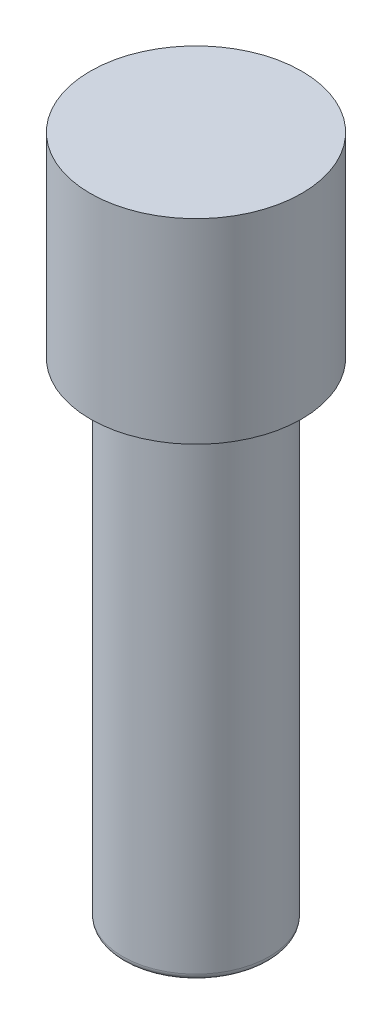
from build123d import *

# Parameters (mm, degrees)
CROQUIS1_R              = 2.25
CROQUIS1_R_2            = 1.4
SALIENTE_EXTRUIR1_DEPTH = 10
SALIENTE_EXTRUIR2_START = 10
CROQUIS1_2_R            = 2.25
SALIENTE_EXTRUIR2_DEPTH = 5
REDONDEO1_R             = 0.2
CROQUIS2_R              = 3.25
SALIENTE_EXTRUIR3_DEPTH = 6


with BuildPart() as part:
    # Croquis1 → Saliente-Extruir1 (new body)
    with BuildSketch(Plane(origin=(0, 0, 0), x_dir=(1, 0, 0), z_dir=(0, 1, 0))):
        with Locations(Location((0, 0, 0), (0, 0, 270))):
            Circle(CROQUIS1_R)
        with Locations(Location((0, 0, 0), (0, 0, 270))):
            Circle(CROQUIS1_R_2, mode=Mode.SUBTRACT)
    extrude(amount=SALIENTE_EXTRUIR1_DEPTH)

    # Croquis1_2 → Saliente-Extruir2 (add)
    with BuildSketch(Plane(origin=(0, 0, 0), x_dir=(1, 0, 0), z_dir=(0, 1, 0)).offset(SALIENTE_EXTRUIR2_START)):
        with Locations(Location((0, 0, 0), (0, 0, 270))):
            Circle(CROQUIS1_2_R)
    extrude(amount=SALIENTE_EXTRUIR2_DEPTH)

    # Redondeo1
    redondeo1_edges = [part.edges().sort_by_distance(p)[0] for p in [
        (0, 0, -2.25),
    ]]
    fillet(redondeo1_edges, radius=REDONDEO1_R)

    # Croquis2 → Saliente-Extruir3 (add)
    with BuildSketch(Plane(origin=(0, 15, 0), x_dir=(1, 0, 0), z_dir=(0, 1, 0))):
        with Locations(Location((0, 0, 0), (0, 0, 270))):
            Circle(CROQUIS2_R)
    extrude(amount=SALIENTE_EXTRUIR3_DEPTH)


solid = part.part
